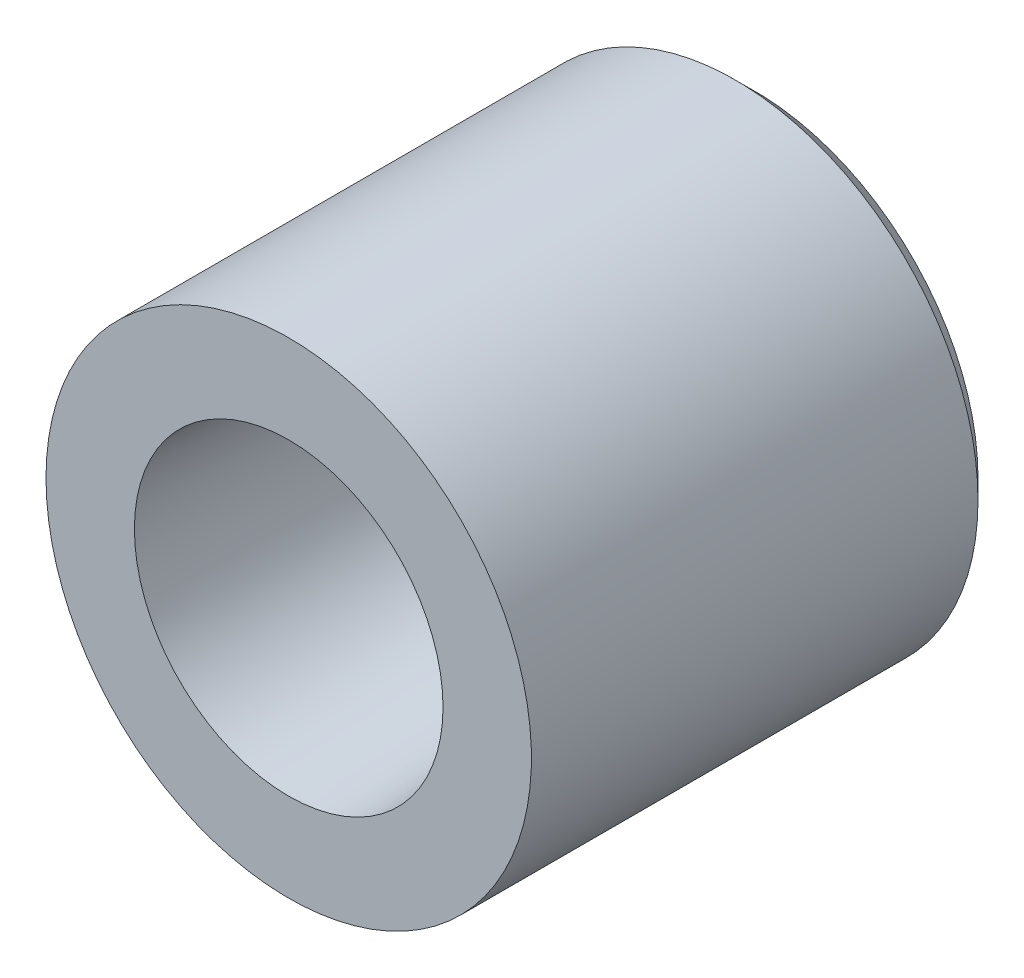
ISO-10303-21;
HEADER;
FILE_DESCRIPTION(('STEP AP214'),'2;1');
FILE_NAME('part.step','',(''),(''),'','','');
FILE_SCHEMA(('AUTOMOTIVE_DESIGN { 1 0 10303 214 1 1 1 1 }'));
ENDSEC;
DATA;
#1=APPLICATION_CONTEXT('core data for automotive mechanical design processes');
#2=APPLICATION_PROTOCOL_DEFINITION('international standard','automotive_design',2000,#1);
#3=PRODUCT_CONTEXT('',#1,'mechanical');
#4=PRODUCT('Part','Part','',(#3));
#5=PRODUCT_RELATED_PRODUCT_CATEGORY('part','',(#4));
#6=PRODUCT_DEFINITION_FORMATION('','',#4);
#7=PRODUCT_DEFINITION_CONTEXT('part definition',#1,'design');
#8=PRODUCT_DEFINITION('design','',#6,#7);
#9=PRODUCT_DEFINITION_SHAPE('','',#8);
#10=(LENGTH_UNIT() NAMED_UNIT(*) SI_UNIT(.MILLI.,.METRE.));
#11=(NAMED_UNIT(*) PLANE_ANGLE_UNIT() SI_UNIT($,.RADIAN.));
#12=(NAMED_UNIT(*) SI_UNIT($,.STERADIAN.) SOLID_ANGLE_UNIT());
#13=UNCERTAINTY_MEASURE_WITH_UNIT(LENGTH_MEASURE(1.E-05),#10,'distance_accuracy_value','');
#14=(GEOMETRIC_REPRESENTATION_CONTEXT(3) GLOBAL_UNCERTAINTY_ASSIGNED_CONTEXT((#13)) GLOBAL_UNIT_ASSIGNED_CONTEXT((#10,
#11,#12)) REPRESENTATION_CONTEXT('',''));
#15=CARTESIAN_POINT('',(0.,0.,0.));
#16=DIRECTION('',(0.,0.,1.));
#17=DIRECTION('',(1.,0.,0.));
#18=AXIS2_PLACEMENT_3D('',#15,#16,#17);
#19=CARTESIAN_POINT('',(0.,0.,-10.9467876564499));
#20=DIRECTION('',(0.,0.,1.));
#21=DIRECTION('',(1.,0.,0.));
#22=AXIS2_PLACEMENT_3D('',#19,#20,#21);
#23=CONICAL_SURFACE('',#22,10.4243189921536,0.785398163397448);
#24=CARTESIAN_POINT('',(-1.04744440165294E-13,0.,-15.));
#25=DIRECTION('',(0.,0.,1.));
#26=DIRECTION('',(-1.,0.,0.));
#27=AXIS2_PLACEMENT_3D('',#24,#25,#26);
#28=CIRCLE('',#27,6.37110664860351);
#29=CARTESIAN_POINT('',(6.3711066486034,0.,-15.));
#30=VERTEX_POINT('',#29);
#31=CARTESIAN_POINT('',(-6.37110664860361,0.,-15.));
#32=VERTEX_POINT('',#31);
#33=EDGE_CURVE('E142',#30,#32,#28,.T.);
#34=ORIENTED_EDGE('',*,*,#33,.F.);
#35=CARTESIAN_POINT('',(6.37110665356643,0.,-14.999999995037));
#36=CARTESIAN_POINT('',(7.37110951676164,0.,-13.9999971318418));
#37=B_SPLINE_CURVE_WITH_KNOTS('',1,(#35,#36),.UNSPECIFIED.,.F.,.F.,(2,2),(0.611177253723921,
0.707107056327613),.UNSPECIFIED.);
#38=CARTESIAN_POINT('',(7.37110664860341,0.,-14.));
#39=VERTEX_POINT('',#38);
#40=EDGE_CURVE('E44',#30,#39,#37,.T.);
#41=ORIENTED_EDGE('',*,*,#40,.T.);
#42=CARTESIAN_POINT('',(0.,0.,-14.));
#43=DIRECTION('',(0.,0.,-1.));
#44=DIRECTION('',(-1.,0.,0.));
#45=AXIS2_PLACEMENT_3D('',#42,#43,#44);
#46=CIRCLE('',#45,7.37110664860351);
#47=CARTESIAN_POINT('',(-7.37110664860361,0.,-14.));
#48=VERTEX_POINT('',#47);
#49=EDGE_CURVE('E11',#48,#39,#46,.T.);
#50=ORIENTED_EDGE('',*,*,#49,.F.);
#51=CARTESIAN_POINT('',(0.,0.,-14.));
#52=DIRECTION('',(0.,0.,-1.));
#53=DIRECTION('',(-1.,0.,0.));
#54=AXIS2_PLACEMENT_3D('',#51,#52,#53);
#55=CIRCLE('',#54,7.37110664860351);
#56=EDGE_CURVE('E51',#39,#48,#55,.T.);
#57=ORIENTED_EDGE('',*,*,#56,.F.);
#58=ORIENTED_EDGE('',*,*,#40,.F.);
#59=CARTESIAN_POINT('',(-1.04744440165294E-13,0.,-15.));
#60=DIRECTION('',(0.,0.,1.));
#61=DIRECTION('',(-1.,0.,0.));
#62=AXIS2_PLACEMENT_3D('',#59,#60,#61);
#63=CIRCLE('',#62,6.37110664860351);
#64=EDGE_CURVE('E59',#32,#30,#63,.T.);
#65=ORIENTED_EDGE('',*,*,#64,.F.);
#66=EDGE_LOOP('',(#34,#41,#50,#57,#58,#65));
#67=FACE_BOUND('',#66,.T.);
#68=ADVANCED_FACE('F36',(#67),#23,.F.);
#69=CARTESIAN_POINT('',(0.,0.,-13.5));
#70=DIRECTION('',(0.,0.,-1.));
#71=DIRECTION('',(-1.,0.,0.));
#72=AXIS2_PLACEMENT_3D('',#69,#70,#71);
#73=CYLINDRICAL_SURFACE('',#72,7.37110664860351);
#74=CARTESIAN_POINT('',(0.,0.,-12.));
#75=DIRECTION('',(0.,0.,-1.));
#76=DIRECTION('',(-1.,0.,0.));
#77=AXIS2_PLACEMENT_3D('',#74,#75,#76);
#78=CIRCLE('',#77,7.37110664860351);
#79=CARTESIAN_POINT('',(-7.37110664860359,0.,-12.));
#80=VERTEX_POINT('',#79);
#81=EDGE_CURVE('E151',#80,#80,#78,.T.);
#82=ORIENTED_EDGE('',*,*,#81,.F.);
#83=CARTESIAN_POINT('',(-7.37110664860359,0.,-11.9999969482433));
#84=CARTESIAN_POINT('',(-7.3711066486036,0.,-14.000002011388));
#85=B_SPLINE_CURVE_WITH_KNOTS('',1,(#83,#84),.UNSPECIFIED.,.F.,.F.,(2,2),(0.0833320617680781,
0.91666750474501),.UNSPECIFIED.);
#86=EDGE_CURVE('E146',#80,#48,#85,.T.);
#87=ORIENTED_EDGE('',*,*,#86,.T.);
#88=ORIENTED_EDGE('',*,*,#49,.T.);
#89=ORIENTED_EDGE('',*,*,#56,.T.);
#90=ORIENTED_EDGE('',*,*,#86,.F.);
#91=EDGE_LOOP('',(#82,#87,#88,#89,#90));
#92=FACE_BOUND('',#91,.T.);
#93=ADVANCED_FACE('F192',(#92),#73,.F.);
#94=CARTESIAN_POINT('',(14.653545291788,-13.2420964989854,-15.));
#95=DIRECTION('',(0.,0.,-1.));
#96=DIRECTION('',(-1.,0.,0.));
#97=AXIS2_PLACEMENT_3D('',#94,#95,#96);
#98=PLANE('',#97);
#99=CARTESIAN_POINT('',(-1.74574066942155E-13,0.,-14.9999999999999));
#100=DIRECTION('',(0.,0.,-1.));
#101=DIRECTION('',(-1.,0.,0.));
#102=AXIS2_PLACEMENT_3D('',#99,#100,#101);
#103=CIRCLE('',#102,3.39999999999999);
#104=CARTESIAN_POINT('',(-3.40000000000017,0.,-14.9999999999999));
#105=VERTEX_POINT('',#104);
#106=EDGE_CURVE('E39',#105,#105,#103,.T.);
#107=ORIENTED_EDGE('',*,*,#106,.T.);
#108=EDGE_LOOP('',(#107));
#109=FACE_BOUND('',#108,.T.);
#110=ORIENTED_EDGE('',*,*,#64,.T.);
#111=ORIENTED_EDGE('',*,*,#33,.T.);
#112=EDGE_LOOP('',(#110,#111));
#113=FACE_BOUND('',#112,.T.);
#114=ADVANCED_FACE('F194',(#109,#113),#98,.F.);
#115=CARTESIAN_POINT('',(0.,0.,-1.));
#116=DIRECTION('',(0.,0.,1.));
#117=DIRECTION('',(-1.,0.,0.));
#118=AXIS2_PLACEMENT_3D('',#115,#116,#117);
#119=CONICAL_SURFACE('',#118,7.94759222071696,0.0523598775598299);
#120=ORIENTED_EDGE('',*,*,#81,.T.);
#121=CARTESIAN_POINT('',(-7.37110664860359,0.,-12.));
#122=CARTESIAN_POINT('',(-7.94759222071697,0.,-0.999999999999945));
#123=B_SPLINE_CURVE_WITH_KNOTS('',1,(#121,#122),.UNSPECIFIED.,.F.,.F.,(2,2),(0.,1.),.UNSPECIFIED.);
#124=CARTESIAN_POINT('',(-7.94759222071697,0.,-0.999999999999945));
#125=VERTEX_POINT('',#124);
#126=EDGE_CURVE('E107',#80,#125,#123,.T.);
#127=ORIENTED_EDGE('',*,*,#126,.T.);
#128=CARTESIAN_POINT('',(0.,0.,-1.));
#129=DIRECTION('',(0.,0.,-1.));
#130=DIRECTION('',(1.,0.,0.));
#131=AXIS2_PLACEMENT_3D('',#128,#129,#130);
#132=CIRCLE('',#131,7.94759222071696);
#133=CARTESIAN_POINT('',(7.94759222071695,0.,-1.00000000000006));
#134=VERTEX_POINT('',#133);
#135=EDGE_CURVE('E132',#134,#125,#132,.T.);
#136=ORIENTED_EDGE('',*,*,#135,.F.);
#137=CARTESIAN_POINT('',(0.,0.,-1.));
#138=DIRECTION('',(0.,0.,-1.));
#139=DIRECTION('',(1.,0.,0.));
#140=AXIS2_PLACEMENT_3D('',#137,#138,#139);
#141=CIRCLE('',#140,7.94759222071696);
#142=EDGE_CURVE('E125',#125,#134,#141,.T.);
#143=ORIENTED_EDGE('',*,*,#142,.F.);
#144=ORIENTED_EDGE('',*,*,#126,.F.);
#145=EDGE_LOOP('',(#120,#127,#136,#143,#144));
#146=FACE_BOUND('',#145,.T.);
#147=ADVANCED_FACE('F190',(#146),#119,.F.);
#148=CARTESIAN_POINT('',(-1.31435631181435E-13,0.,-18.8223304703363));
#149=DIRECTION('',(0.,0.,1.));
#150=DIRECTION('',(1.,0.,0.));
#151=AXIS2_PLACEMENT_3D('',#148,#149,#150);
#152=CONICAL_SURFACE('',#151,17.6776695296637,0.785398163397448);
#153=CARTESIAN_POINT('',(-1.74574066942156E-13,0.,-25.));
#154=DIRECTION('',(0.,0.,1.));
#155=DIRECTION('',(-1.,0.,0.));
#156=AXIS2_PLACEMENT_3D('',#153,#154,#155);
#157=CIRCLE('',#156,11.5);
#158=CARTESIAN_POINT('',(-11.5000000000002,0.,-25.));
#159=VERTEX_POINT('',#158);
#160=CARTESIAN_POINT('',(11.4999999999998,0.,-25.));
#161=VERTEX_POINT('',#160);
#162=EDGE_CURVE('E90',#159,#161,#157,.T.);
#163=ORIENTED_EDGE('',*,*,#162,.T.);
#164=CARTESIAN_POINT('',(11.499996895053,0.,-25.000003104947));
#165=CARTESIAN_POINT('',(12.4999974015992,0.,-24.0000025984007));
#166=B_SPLINE_CURVE_WITH_KNOTS('',1,(#164,#165),.UNSPECIFIED.,.F.,.F.,(2,2),(0.650538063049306,
0.707106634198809),.UNSPECIFIED.);
#167=CARTESIAN_POINT('',(12.4999999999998,0.,-24.));
#168=VERTEX_POINT('',#167);
#169=EDGE_CURVE('E95',#161,#168,#166,.T.);
#170=ORIENTED_EDGE('',*,*,#169,.T.);
#171=CARTESIAN_POINT('',(-1.6759110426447E-13,0.,-24.));
#172=DIRECTION('',(0.,0.,-1.));
#173=DIRECTION('',(-1.,0.,0.));
#174=AXIS2_PLACEMENT_3D('',#171,#172,#173);
#175=CIRCLE('',#174,12.5);
#176=CARTESIAN_POINT('',(-12.5000000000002,0.,-24.));
#177=VERTEX_POINT('',#176);
#178=EDGE_CURVE('E102',#168,#177,#175,.T.);
#179=ORIENTED_EDGE('',*,*,#178,.T.);
#180=CARTESIAN_POINT('',(-1.6759110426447E-13,0.,-24.));
#181=DIRECTION('',(0.,0.,-1.));
#182=DIRECTION('',(-1.,0.,0.));
#183=AXIS2_PLACEMENT_3D('',#180,#181,#182);
#184=CIRCLE('',#183,12.5);
#185=EDGE_CURVE('E104',#177,#168,#184,.T.);
#186=ORIENTED_EDGE('',*,*,#185,.T.);
#187=ORIENTED_EDGE('',*,*,#169,.F.);
#188=CARTESIAN_POINT('',(-1.74574066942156E-13,0.,-25.));
#189=DIRECTION('',(0.,0.,1.));
#190=DIRECTION('',(-1.,0.,0.));
#191=AXIS2_PLACEMENT_3D('',#188,#189,#190);
#192=CIRCLE('',#191,11.5);
#193=EDGE_CURVE('E97',#161,#159,#192,.T.);
#194=ORIENTED_EDGE('',*,*,#193,.T.);
#195=EDGE_LOOP('',(#163,#170,#179,#186,#187,#194));
#196=FACE_BOUND('',#195,.T.);
#197=ADVANCED_FACE('F92',(#196),#152,.T.);
#198=CARTESIAN_POINT('',(0.,0.,-13.));
#199=DIRECTION('',(0.,0.,-1.));
#200=DIRECTION('',(-1.,0.,0.));
#201=AXIS2_PLACEMENT_3D('',#198,#199,#200);
#202=CYLINDRICAL_SURFACE('',#201,12.5);
#203=CARTESIAN_POINT('',(0.,0.,-1.));
#204=DIRECTION('',(0.,0.,1.));
#205=DIRECTION('',(-1.,0.,0.));
#206=AXIS2_PLACEMENT_3D('',#203,#204,#205);
#207=CIRCLE('',#206,12.5);
#208=CARTESIAN_POINT('',(-12.5,0.,-0.999999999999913));
#209=VERTEX_POINT('',#208);
#210=EDGE_CURVE('E99',#209,#209,#207,.T.);
#211=ORIENTED_EDGE('',*,*,#210,.F.);
#212=CARTESIAN_POINT('',(-12.5,0.,-0.999999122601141));
#213=CARTESIAN_POINT('',(-12.5000000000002,0.,-24.00000211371));
#214=B_SPLINE_CURVE_WITH_KNOTS('',1,(#212,#213),.UNSPECIFIED.,.F.,.F.,(2,2),(0.0833333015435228,
0.916666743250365),.UNSPECIFIED.);
#215=EDGE_CURVE('E172',#209,#177,#214,.T.);
#216=ORIENTED_EDGE('',*,*,#215,.T.);
#217=ORIENTED_EDGE('',*,*,#178,.F.);
#218=ORIENTED_EDGE('',*,*,#185,.F.);
#219=ORIENTED_EDGE('',*,*,#215,.F.);
#220=EDGE_LOOP('',(#211,#216,#217,#218,#219));
#221=FACE_BOUND('',#220,.T.);
#222=ADVANCED_FACE('F226',(#221),#202,.T.);
#223=CARTESIAN_POINT('',(26.45,-23.9023011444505,-25.));
#224=DIRECTION('',(0.,0.,-1.));
#225=DIRECTION('',(-1.,0.,0.));
#226=AXIS2_PLACEMENT_3D('',#223,#224,#225);
#227=PLANE('',#226);
#228=CARTESIAN_POINT('',(-1.74574066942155E-13,0.,-24.9999999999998));
#229=DIRECTION('',(0.,0.,-1.));
#230=DIRECTION('',(-1.,0.,0.));
#231=AXIS2_PLACEMENT_3D('',#228,#229,#230);
#232=CIRCLE('',#231,3.39999999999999);
#233=CARTESIAN_POINT('',(-3.40000000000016,0.,-24.9999999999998));
#234=VERTEX_POINT('',#233);
#235=EDGE_CURVE('E276',#234,#234,#232,.T.);
#236=ORIENTED_EDGE('',*,*,#235,.F.);
#237=EDGE_LOOP('',(#236));
#238=FACE_BOUND('',#237,.T.);
#239=ORIENTED_EDGE('',*,*,#193,.F.);
#240=ORIENTED_EDGE('',*,*,#162,.F.);
#241=EDGE_LOOP('',(#239,#240));
#242=FACE_BOUND('',#241,.T.);
#243=ADVANCED_FACE('F101',(#238,#242),#227,.T.);
#244=CARTESIAN_POINT('',(-16.25,-25.9807621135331,-0.999999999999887));
#245=DIRECTION('',(0.,0.,1.));
#246=DIRECTION('',(1.,0.,0.));
#247=AXIS2_PLACEMENT_3D('',#244,#245,#246);
#248=PLANE('',#247);
#249=ORIENTED_EDGE('',*,*,#210,.T.);
#250=EDGE_LOOP('',(#249));
#251=FACE_BOUND('',#250,.T.);
#252=ORIENTED_EDGE('',*,*,#135,.T.);
#253=ORIENTED_EDGE('',*,*,#142,.T.);
#254=EDGE_LOOP('',(#252,#253));
#255=FACE_BOUND('',#254,.T.);
#256=ADVANCED_FACE('F241',(#251,#255),#248,.T.);
#257=CARTESIAN_POINT('',(-1.74574066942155E-13,0.,-24.9999999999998));
#258=DIRECTION('',(0.,0.,-1.));
#259=DIRECTION('',(-1.,0.,0.));
#260=AXIS2_PLACEMENT_3D('',#257,#258,#259);
#261=CYLINDRICAL_SURFACE('',#260,3.39999999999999);
#262=ORIENTED_EDGE('',*,*,#235,.T.);
#263=EDGE_LOOP('',(#262));
#264=FACE_BOUND('',#263,.T.);
#265=ORIENTED_EDGE('',*,*,#106,.F.);
#266=EDGE_LOOP('',(#265));
#267=FACE_BOUND('',#266,.T.);
#268=ADVANCED_FACE('F249',(#264,#267),#261,.F.);
#269=CLOSED_SHELL('',(#68,#93,#114,#147,#197,#222,#243,#256,#268));
#270=MANIFOLD_SOLID_BREP('B2',#269);
#271=ADVANCED_BREP_SHAPE_REPRESENTATION('',(#18,#270),#14);
#272=SHAPE_DEFINITION_REPRESENTATION(#9,#271);
ENDSEC;
END-ISO-10303-21;
